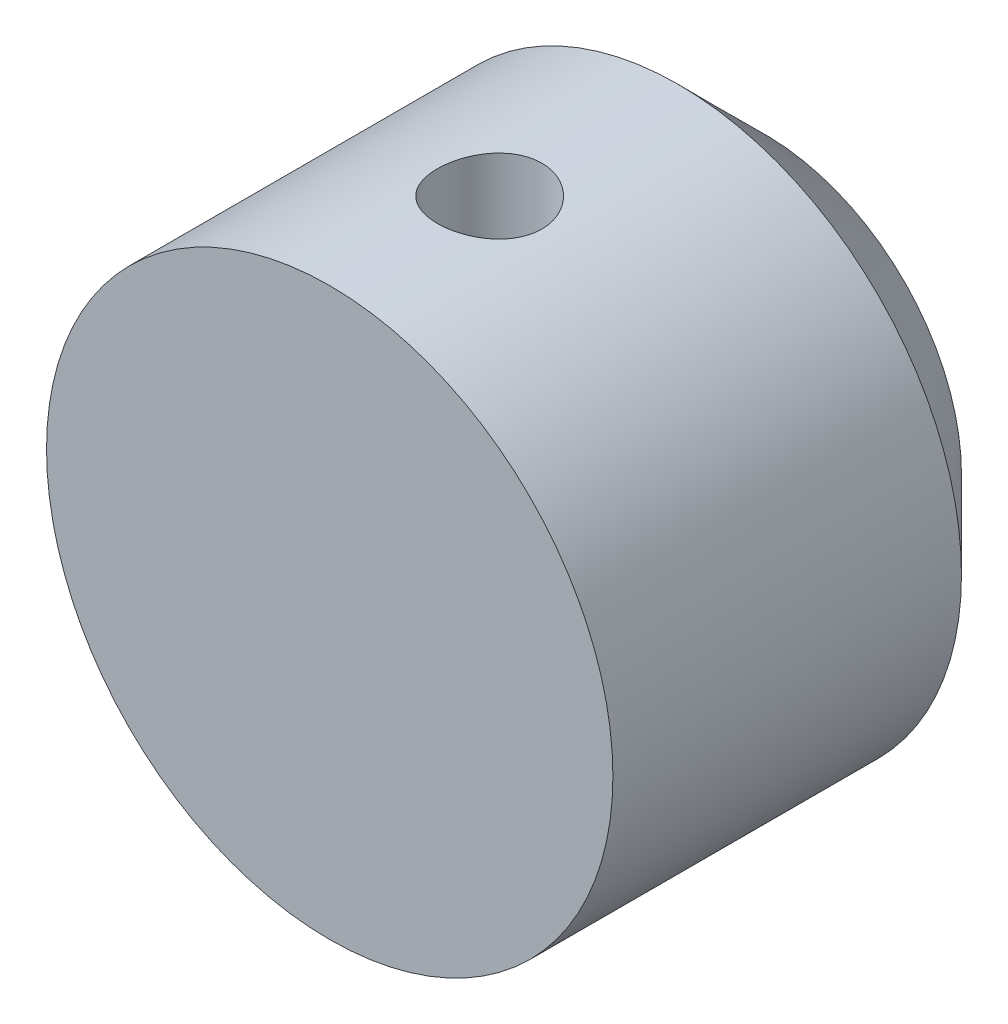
from build123d import *

# Parameters (mm, degrees)
SKETCH_1_R               = 32.5
EXTRUDE_1_DEPTH          = 50
CUT_EXTRUDE_1_DEPTH      = 68.915388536
CUT_EXTRUDE_1_DEPTH_BACK = 68.915388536
SKETCH_2_R               = 6
CHAMFER_3_SIZE           = 10


with BuildPart() as part:
    # Sketch 1 → Extrude 1 (new body)
    with BuildSketch(Plane.XY):
        Circle(SKETCH_1_R)
    extrude(amount=EXTRUDE_1_DEPTH)

    # Sketch 2 → Cut-Extrude 1 (cut, two sides: drawn at the far end of the back side and taken through both)
    with BuildSketch(Plane(origin=(0, 0, 0), x_dir=(1, 0, 0), z_dir=(0, 1, 0)).offset(-CUT_EXTRUDE_1_DEPTH_BACK)):
        with Locations(Location((0, -31.65072441, 0), (0, 0, 270))):
            Circle(SKETCH_2_R)
    extrude(amount=CUT_EXTRUDE_1_DEPTH + CUT_EXTRUDE_1_DEPTH_BACK, mode=Mode.SUBTRACT)

    # Chamfer 3
    chamfer_3_edges = [part.edges().sort_by_distance(p)[0] for p in [
        (-32.5, 0, 0),
    ]]
    chamfer(chamfer_3_edges, length=CHAMFER_3_SIZE)


solid = part.part
